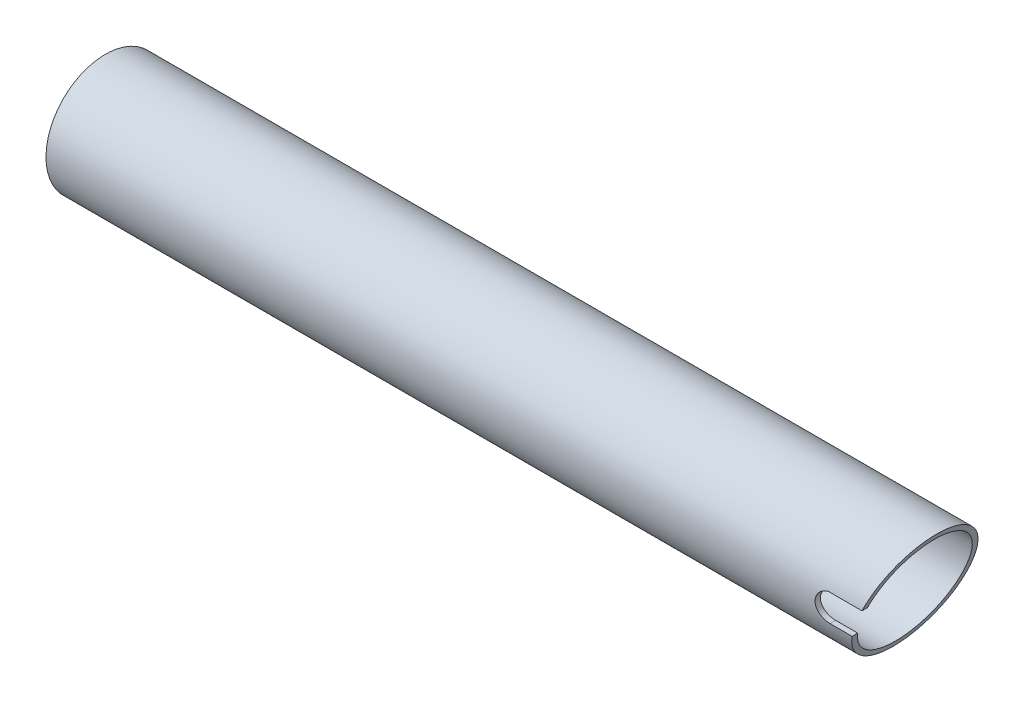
ISO-10303-21;
HEADER;
FILE_DESCRIPTION(('STEP AP214'),'2;1');
FILE_NAME('part.step','',(''),(''),'','','');
FILE_SCHEMA(('AUTOMOTIVE_DESIGN { 1 0 10303 214 1 1 1 1 }'));
ENDSEC;
DATA;
#1=APPLICATION_CONTEXT('core data for automotive mechanical design processes');
#2=APPLICATION_PROTOCOL_DEFINITION('international standard','automotive_design',2000,#1);
#3=PRODUCT_CONTEXT('',#1,'mechanical');
#4=PRODUCT('Part','Part','',(#3));
#5=PRODUCT_RELATED_PRODUCT_CATEGORY('part','',(#4));
#6=PRODUCT_DEFINITION_FORMATION('','',#4);
#7=PRODUCT_DEFINITION_CONTEXT('part definition',#1,'design');
#8=PRODUCT_DEFINITION('design','',#6,#7);
#9=PRODUCT_DEFINITION_SHAPE('','',#8);
#10=(LENGTH_UNIT() NAMED_UNIT(*) SI_UNIT(.MILLI.,.METRE.));
#11=(NAMED_UNIT(*) PLANE_ANGLE_UNIT() SI_UNIT($,.RADIAN.));
#12=(NAMED_UNIT(*) SI_UNIT($,.STERADIAN.) SOLID_ANGLE_UNIT());
#13=UNCERTAINTY_MEASURE_WITH_UNIT(LENGTH_MEASURE(1.E-05),#10,'distance_accuracy_value','');
#14=(GEOMETRIC_REPRESENTATION_CONTEXT(3) GLOBAL_UNCERTAINTY_ASSIGNED_CONTEXT((#13)) GLOBAL_UNIT_ASSIGNED_CONTEXT((#10,
#11,#12)) REPRESENTATION_CONTEXT('',''));
#15=CARTESIAN_POINT('',(0.,0.,0.));
#16=DIRECTION('',(0.,0.,1.));
#17=DIRECTION('',(1.,0.,0.));
#18=AXIS2_PLACEMENT_3D('',#15,#16,#17);
#19=CARTESIAN_POINT('',(160.,0.,0.));
#20=DIRECTION('',(-1.,0.,0.));
#21=DIRECTION('',(0.,0.,1.));
#22=AXIS2_PLACEMENT_3D('',#19,#20,#21);
#23=CYLINDRICAL_SURFACE('',#22,11.);
#24=CARTESIAN_POINT('',(0.,0.,0.));
#25=DIRECTION('',(1.,0.,0.));
#26=DIRECTION('',(0.,0.,-1.));
#27=AXIS2_PLACEMENT_3D('',#24,#25,#26);
#28=CIRCLE('',#27,11.);
#29=CARTESIAN_POINT('',(0.,0.,-11.));
#30=VERTEX_POINT('',#29);
#31=EDGE_CURVE('E92',#30,#30,#28,.T.);
#32=ORIENTED_EDGE('',*,*,#31,.T.);
#33=EDGE_LOOP('',(#32));
#34=FACE_BOUND('',#33,.T.);
#35=DIRECTION('',(-1.,0.,0.));
#36=VECTOR('',#35,1.);
#37=CARTESIAN_POINT('',(160.,2.50000000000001,10.7121426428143));
#38=LINE('',#37,#36);
#39=CARTESIAN_POINT('',(150.909925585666,2.5,10.7121426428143));
#40=VERTEX_POINT('',#39);
#41=CARTESIAN_POINT('',(145.,2.5,10.7121426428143));
#42=VERTEX_POINT('',#41);
#43=EDGE_CURVE('E106',#40,#42,#38,.T.);
#44=ORIENTED_EDGE('',*,*,#43,.F.);
#45=CARTESIAN_POINT('',(150.,0.,0.));
#46=DIRECTION('',(0.939692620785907,-0.342020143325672,0.));
#47=DIRECTION('',(-0.342020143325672,-0.939692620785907,0.));
#48=AXIS2_PLACEMENT_3D('',#45,#46,#47);
#49=ELLIPSE('',#48,11.705955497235,11.);
#50=CARTESIAN_POINT('',(149.090074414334,-2.5,10.7121426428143));
#51=VERTEX_POINT('',#50);
#52=EDGE_CURVE('E101',#51,#40,#49,.T.);
#53=ORIENTED_EDGE('',*,*,#52,.F.);
#54=DIRECTION('',(-1.,0.,0.));
#55=VECTOR('',#54,1.);
#56=CARTESIAN_POINT('',(160.,-2.5,10.7121426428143));
#57=LINE('',#56,#55);
#58=CARTESIAN_POINT('',(145.,-2.5,10.7121426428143));
#59=VERTEX_POINT('',#58);
#60=EDGE_CURVE('E58',#59,#51,#57,.F.);
#61=ORIENTED_EDGE('',*,*,#60,.F.);
#62=CARTESIAN_POINT('',(145.,2.5,10.7121426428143));
#63=CARTESIAN_POINT('',(144.930656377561,2.50000778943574,10.7121357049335));
#64=CARTESIAN_POINT('',(144.861317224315,2.49711498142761,10.7128158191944));
#65=CARTESIAN_POINT('',(144.723153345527,2.4855886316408,10.7154987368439));
#66=CARTESIAN_POINT('',(144.654328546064,2.4769559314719,10.7175013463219));
#67=CARTESIAN_POINT('',(144.517798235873,2.45403037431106,10.7227732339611));
#68=CARTESIAN_POINT('',(144.450090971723,2.43974748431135,10.7260402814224));
#69=CARTESIAN_POINT('',(144.316170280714,2.40565123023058,10.7337386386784));
#70=CARTESIAN_POINT('',(144.249956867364,2.38583781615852,10.7381699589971));
#71=CARTESIAN_POINT('',(144.054249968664,2.3183092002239,10.7530273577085));
#72=CARTESIAN_POINT('',(143.927566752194,2.2624847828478,10.765021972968));
#73=CARTESIAN_POINT('',(143.68540296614,2.1309292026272,10.7918310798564));
#74=CARTESIAN_POINT('',(143.569924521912,2.05519427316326,10.8066461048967));
#75=CARTESIAN_POINT('',(143.351294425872,1.88448995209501,10.8377270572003));
#76=CARTESIAN_POINT('',(143.248373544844,1.78922803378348,10.8540126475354));
#77=CARTESIAN_POINT('',(143.059822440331,1.58280149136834,10.8860291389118));
#78=CARTESIAN_POINT('',(142.974194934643,1.47163437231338,10.9017599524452));
#79=CARTESIAN_POINT('',(142.821735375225,1.23498721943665,10.9311097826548));
#80=CARTESIAN_POINT('',(142.755128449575,1.1093586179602,10.9447027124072));
#81=CARTESIAN_POINT('',(142.644064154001,0.84833678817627,10.9680202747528));
#82=CARTESIAN_POINT('',(142.599602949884,0.712945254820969,10.9777455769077));
#83=CARTESIAN_POINT('',(142.534822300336,0.438657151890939,10.9920932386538));
#84=CARTESIAN_POINT('',(142.514108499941,0.299858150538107,10.9967988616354));
#85=CARTESIAN_POINT('',(142.496176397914,0.0206776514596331,11.000865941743));
#86=CARTESIAN_POINT('',(142.498955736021,-0.119703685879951,11.000227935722));
#87=CARTESIAN_POINT('',(142.52764078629,-0.395334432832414,10.9937426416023));
#88=CARTESIAN_POINT('',(142.55312072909,-0.530630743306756,10.9879912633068));
#89=CARTESIAN_POINT('',(142.625803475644,-0.794974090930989,10.9720354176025));
#90=CARTESIAN_POINT('',(142.673007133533,-0.924020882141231,10.9618307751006));
#91=CARTESIAN_POINT('',(142.788166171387,-1.17337116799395,10.9379625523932));
#92=CARTESIAN_POINT('',(142.856280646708,-1.29359855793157,10.9242725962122));
#93=CARTESIAN_POINT('',(143.011207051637,-1.52106697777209,10.8949312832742));
#94=CARTESIAN_POINT('',(143.09802120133,-1.62830646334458,10.879279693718));
#95=CARTESIAN_POINT('',(143.290179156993,-1.82928124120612,10.8473190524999));
#96=CARTESIAN_POINT('',(143.395893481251,-1.92266146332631,10.8310031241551));
#97=CARTESIAN_POINT('',(143.621683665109,-2.09046125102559,10.7998740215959));
#98=CARTESIAN_POINT('',(143.74176343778,-2.16487563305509,10.7850612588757));
#99=CARTESIAN_POINT('',(143.993500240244,-2.29281096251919,10.7585928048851));
#100=CARTESIAN_POINT('',(144.125201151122,-2.34624817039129,10.7469498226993));
#101=CARTESIAN_POINT('',(144.395960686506,-2.43005142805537,10.7283141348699));
#102=CARTESIAN_POINT('',(144.535008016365,-2.46045185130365,10.7213145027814));
#103=CARTESIAN_POINT('',(144.729346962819,-2.48590221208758,10.7154245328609));
#104=CARTESIAN_POINT('',(144.783381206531,-2.49119027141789,10.71419544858));
#105=CARTESIAN_POINT('',(144.891601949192,-2.49823495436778,10.7125550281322));
#106=CARTESIAN_POINT('',(144.945788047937,-2.49999741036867,10.7121423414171));
#107=CARTESIAN_POINT('',(145.,-2.5,10.7121426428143));
#108=B_SPLINE_CURVE_WITH_KNOTS('',3,(#62,#63,#64,#65,#66,#67,#68,#69,#70,#71,#72,#73,#74,#75,
#76,#77,#78,#79,#80,#81,#82,#83,#84,#85,#86,#87,#88,#89,#90,#91,#92,#93,#94,#95,#96,#97,#98,#99,
#100,#101,#102,#103,#104,#105,#106,#107),.UNSPECIFIED.,.F.,.F.,(4,2,2,2,2,2,2,2,2,2,2,2,2,2,2,2,
2,2,2,2,2,2,4),(0.,0.207959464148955,0.415888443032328,0.623452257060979,0.831017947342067,
1.24577925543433,1.66061908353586,2.08219920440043,2.50384552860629,2.93029316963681,
3.35666695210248,3.77585276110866,4.19499645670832,4.60644048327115,5.01790068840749,
5.43257241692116,5.84729340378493,6.27127621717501,6.69537478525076,7.12114951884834,
7.54628769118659,7.70911145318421,7.87166563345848),.UNSPECIFIED.);
#109=EDGE_CURVE('E102',#42,#59,#108,.T.);
#110=ORIENTED_EDGE('',*,*,#109,.F.);
#111=EDGE_LOOP('',(#44,#53,#61,#110));
#112=FACE_BOUND('',#111,.T.);
#113=ADVANCED_FACE('F38',(#34,#112),#23,.T.);
#114=CARTESIAN_POINT('',(160.,0.,0.));
#115=DIRECTION('',(-1.,0.,0.));
#116=DIRECTION('',(0.,0.,1.));
#117=AXIS2_PLACEMENT_3D('',#114,#115,#116);
#118=CYLINDRICAL_SURFACE('',#117,10.);
#119=CARTESIAN_POINT('',(0.,0.,0.));
#120=DIRECTION('',(1.,0.,0.));
#121=DIRECTION('',(0.,0.,-1.));
#122=AXIS2_PLACEMENT_3D('',#119,#120,#121);
#123=CIRCLE('',#122,10.);
#124=CARTESIAN_POINT('',(0.,0.,-10.));
#125=VERTEX_POINT('',#124);
#126=EDGE_CURVE('E104',#125,#125,#123,.T.);
#127=ORIENTED_EDGE('',*,*,#126,.F.);
#128=EDGE_LOOP('',(#127));
#129=FACE_BOUND('',#128,.T.);
#130=CARTESIAN_POINT('',(150.,0.,0.));
#131=DIRECTION('',(0.939692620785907,-0.342020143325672,0.));
#132=DIRECTION('',(-0.342020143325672,-0.939692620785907,0.));
#133=AXIS2_PLACEMENT_3D('',#130,#131,#132);
#134=ELLIPSE('',#133,10.6417777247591,10.);
#135=CARTESIAN_POINT('',(149.090074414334,-2.5,9.68245836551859));
#136=VERTEX_POINT('',#135);
#137=CARTESIAN_POINT('',(150.909925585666,2.5,9.68245836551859));
#138=VERTEX_POINT('',#137);
#139=EDGE_CURVE('E97',#136,#138,#134,.T.);
#140=ORIENTED_EDGE('',*,*,#139,.T.);
#141=DIRECTION('',(-1.,0.,0.));
#142=VECTOR('',#141,1.);
#143=CARTESIAN_POINT('',(160.,2.50000000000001,9.68245836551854));
#144=LINE('',#143,#142);
#145=CARTESIAN_POINT('',(145.,2.5,9.68245836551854));
#146=VERTEX_POINT('',#145);
#147=EDGE_CURVE('E66',#138,#146,#144,.T.);
#148=ORIENTED_EDGE('',*,*,#147,.T.);
#149=CARTESIAN_POINT('',(145.,2.5,9.68245836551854));
#150=CARTESIAN_POINT('',(144.93086221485,2.5000080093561,9.68245064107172));
#151=CARTESIAN_POINT('',(144.861729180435,2.49713210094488,9.68319871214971));
#152=CARTESIAN_POINT('',(144.723980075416,2.4856746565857,9.68614915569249));
#153=CARTESIAN_POINT('',(144.655363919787,2.477094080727,9.68835128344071));
#154=CARTESIAN_POINT('',(144.519267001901,2.4543119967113,9.69414685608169));
#155=CARTESIAN_POINT('',(144.451784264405,2.44012162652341,9.69773754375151));
#156=CARTESIAN_POINT('',(144.31831118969,2.40625174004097,9.70619672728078));
#157=CARTESIAN_POINT('',(144.252320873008,2.3865721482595,9.71106524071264));
#158=CARTESIAN_POINT('',(144.057289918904,2.31951549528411,9.72738369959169));
#159=CARTESIAN_POINT('',(143.93105255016,2.26409745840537,9.74055281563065));
#160=CARTESIAN_POINT('',(143.689694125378,2.13353299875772,9.76997886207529));
#161=CARTESIAN_POINT('',(143.57457606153,2.05838128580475,9.78623662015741));
#162=CARTESIAN_POINT('',(143.356147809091,1.88871268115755,9.82040642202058));
#163=CARTESIAN_POINT('',(143.253114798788,1.79384357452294,9.838344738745));
#164=CARTESIAN_POINT('',(143.06424276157,1.58818904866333,9.87362764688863));
#165=CARTESIAN_POINT('',(142.978406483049,1.47740109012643,9.89097214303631));
#166=CARTESIAN_POINT('',(142.825223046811,1.24114235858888,9.92340454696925));
#167=CARTESIAN_POINT('',(142.758150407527,1.11548838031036,9.93845761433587));
#168=CARTESIAN_POINT('',(142.64618801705,0.854256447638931,9.96430865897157));
#169=CARTESIAN_POINT('',(142.601293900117,0.718680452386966,9.97510747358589));
#170=CARTESIAN_POINT('',(142.535852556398,0.444360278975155,9.99104749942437));
#171=CARTESIAN_POINT('',(142.514830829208,0.305735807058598,9.99629882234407));
#172=CARTESIAN_POINT('',(142.496241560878,0.0268319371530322,10.0009359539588));
#173=CARTESIAN_POINT('',(142.498671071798,-0.113447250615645,10.0003224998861));
#174=CARTESIAN_POINT('',(142.526574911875,-0.388381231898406,9.99338093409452));
#175=CARTESIAN_POINT('',(142.551536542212,-0.523091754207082,9.98717996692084));
#176=CARTESIAN_POINT('',(142.622971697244,-0.7863467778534,9.96990826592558));
#177=CARTESIAN_POINT('',(142.66944617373,-0.914891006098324,9.95883731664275));
#178=CARTESIAN_POINT('',(142.78300320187,-1.16351821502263,9.93287494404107));
#179=CARTESIAN_POINT('',(142.850268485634,-1.28351407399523,9.91794984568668));
#180=CARTESIAN_POINT('',(143.003357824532,-1.51069157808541,9.88589863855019));
#181=CARTESIAN_POINT('',(143.089184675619,-1.61787128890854,9.86877219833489));
#182=CARTESIAN_POINT('',(143.279697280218,-1.81942347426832,9.83363915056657));
#183=CARTESIAN_POINT('',(143.384829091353,-1.9133727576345,9.81562126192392));
#184=CARTESIAN_POINT('',(143.609574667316,-2.08242393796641,9.78115420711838));
#185=CARTESIAN_POINT('',(143.729192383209,-2.15752067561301,9.76470547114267));
#186=CARTESIAN_POINT('',(143.980363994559,-2.28701177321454,9.73519533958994));
#187=CARTESIAN_POINT('',(144.111978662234,-2.34129254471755,9.72215264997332));
#188=CARTESIAN_POINT('',(144.382792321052,-2.42675587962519,9.70117647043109));
#189=CARTESIAN_POINT('',(144.521979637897,-2.45797297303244,9.69323534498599));
#190=CARTESIAN_POINT('',(144.718643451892,-2.48476158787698,9.68638226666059));
#191=CARTESIAN_POINT('',(144.774799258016,-2.49047697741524,9.68491307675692));
#192=CARTESIAN_POINT('',(144.887294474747,-2.49809189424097,9.6829515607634));
#193=CARTESIAN_POINT('',(144.943633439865,-2.49999759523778,9.68245765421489));
#194=CARTESIAN_POINT('',(145.,-2.5,9.68245836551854));
#195=B_SPLINE_CURVE_WITH_KNOTS('',3,(#149,#150,#151,#152,#153,#154,#155,#156,#157,#158,#159,
#160,#161,#162,#163,#164,#165,#166,#167,#168,#169,#170,#171,#172,#173,#174,#175,#176,#177,#178,
#179,#180,#181,#182,#183,#184,#185,#186,#187,#188,#189,#190,#191,#192,#193,#194),.UNSPECIFIED.,
.F.,.F.,(4,2,2,2,2,2,2,2,2,2,2,2,2,2,2,2,2,2,2,2,2,2,4),(0.,0.207341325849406,0.414647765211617,
0.621544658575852,0.828444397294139,1.24183269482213,1.65533192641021,2.07697423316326,
2.49868387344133,2.92627416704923,3.35378025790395,3.77263152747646,4.19143014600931,
4.60093312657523,5.01045422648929,5.42368222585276,5.83697251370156,6.2614052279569,
6.68595396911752,7.11278749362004,7.53898067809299,7.70826570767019,7.87727618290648),.UNSPECIFIED.);
#196=CARTESIAN_POINT('',(145.,-2.5,9.68245836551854));
#197=VERTEX_POINT('',#196);
#198=EDGE_CURVE('E12',#146,#197,#195,.T.);
#199=ORIENTED_EDGE('',*,*,#198,.T.);
#200=DIRECTION('',(-1.,0.,0.));
#201=VECTOR('',#200,1.);
#202=CARTESIAN_POINT('',(160.,-2.5,9.68245836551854));
#203=LINE('',#202,#201);
#204=EDGE_CURVE('E86',#197,#136,#203,.F.);
#205=ORIENTED_EDGE('',*,*,#204,.T.);
#206=EDGE_LOOP('',(#140,#148,#199,#205));
#207=FACE_BOUND('',#206,.T.);
#208=ADVANCED_FACE('F96',(#129,#207),#118,.F.);
#209=CARTESIAN_POINT('',(154.003672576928,11.,217.496165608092));
#210=DIRECTION('',(0.939692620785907,-0.342020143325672,0.));
#211=DIRECTION('',(0.342020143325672,0.939692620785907,0.));
#212=AXIS2_PLACEMENT_3D('',#209,#210,#211);
#213=PLANE('',#212);
#214=ORIENTED_EDGE('',*,*,#52,.T.);
#215=DIRECTION('',(0.,0.,-1.));
#216=VECTOR('',#215,1.);
#217=CARTESIAN_POINT('',(150.909925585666,2.5,217.496165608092));
#218=LINE('',#217,#216);
#219=EDGE_CURVE('E51',#40,#138,#218,.T.);
#220=ORIENTED_EDGE('',*,*,#219,.T.);
#221=ORIENTED_EDGE('',*,*,#139,.F.);
#222=DIRECTION('',(0.,0.,1.));
#223=VECTOR('',#222,1.);
#224=CARTESIAN_POINT('',(149.090074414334,-2.5,217.496165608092));
#225=LINE('',#224,#223);
#226=EDGE_CURVE('E83',#136,#51,#225,.T.);
#227=ORIENTED_EDGE('',*,*,#226,.T.);
#228=EDGE_LOOP('',(#214,#220,#221,#227));
#229=FACE_BOUND('',#228,.T.);
#230=ADVANCED_FACE('F100',(#229),#213,.T.);
#231=CARTESIAN_POINT('',(0.,0.,0.));
#232=DIRECTION('',(1.,0.,0.));
#233=DIRECTION('',(0.,0.,-1.));
#234=AXIS2_PLACEMENT_3D('',#231,#232,#233);
#235=PLANE('',#234);
#236=ORIENTED_EDGE('',*,*,#31,.F.);
#237=EDGE_LOOP('',(#236));
#238=FACE_BOUND('',#237,.T.);
#239=ORIENTED_EDGE('',*,*,#126,.T.);
#240=EDGE_LOOP('',(#239));
#241=FACE_BOUND('',#240,.T.);
#242=ADVANCED_FACE('F123',(#238,#241),#235,.F.);
#243=CARTESIAN_POINT('',(145.,0.,11.));
#244=DIRECTION('',(0.,0.,-1.));
#245=DIRECTION('',(-1.,0.,0.));
#246=AXIS2_PLACEMENT_3D('',#243,#244,#245);
#247=CYLINDRICAL_SURFACE('',#246,2.5);
#248=ORIENTED_EDGE('',*,*,#109,.T.);
#249=DIRECTION('',(0.,0.,-1.));
#250=VECTOR('',#249,1.);
#251=CARTESIAN_POINT('',(145.,-2.5,11.));
#252=LINE('',#251,#250);
#253=EDGE_CURVE('E149',#59,#197,#252,.T.);
#254=ORIENTED_EDGE('',*,*,#253,.T.);
#255=ORIENTED_EDGE('',*,*,#198,.F.);
#256=DIRECTION('',(0.,0.,-1.));
#257=VECTOR('',#256,1.);
#258=CARTESIAN_POINT('',(145.,2.5,11.));
#259=LINE('',#258,#257);
#260=EDGE_CURVE('E98',#42,#146,#259,.T.);
#261=ORIENTED_EDGE('',*,*,#260,.F.);
#262=EDGE_LOOP('',(#248,#254,#255,#261));
#263=FACE_BOUND('',#262,.T.);
#264=ADVANCED_FACE('F117',(#263),#247,.F.);
#265=CARTESIAN_POINT('',(150.909925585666,2.5,11.));
#266=DIRECTION('',(0.,-1.,0.));
#267=DIRECTION('',(1.,0.,0.));
#268=AXIS2_PLACEMENT_3D('',#265,#266,#267);
#269=PLANE('',#268);
#270=ORIENTED_EDGE('',*,*,#43,.T.);
#271=ORIENTED_EDGE('',*,*,#260,.T.);
#272=ORIENTED_EDGE('',*,*,#147,.F.);
#273=ORIENTED_EDGE('',*,*,#219,.F.);
#274=EDGE_LOOP('',(#270,#271,#272,#273));
#275=FACE_BOUND('',#274,.T.);
#276=ADVANCED_FACE('F122',(#275),#269,.T.);
#277=CARTESIAN_POINT('',(145.,-2.5,11.));
#278=DIRECTION('',(0.,1.,0.));
#279=DIRECTION('',(0.,0.,1.));
#280=AXIS2_PLACEMENT_3D('',#277,#278,#279);
#281=PLANE('',#280);
#282=ORIENTED_EDGE('',*,*,#60,.T.);
#283=ORIENTED_EDGE('',*,*,#226,.F.);
#284=ORIENTED_EDGE('',*,*,#204,.F.);
#285=ORIENTED_EDGE('',*,*,#253,.F.);
#286=EDGE_LOOP('',(#282,#283,#284,#285));
#287=FACE_BOUND('',#286,.T.);
#288=ADVANCED_FACE('F85',(#287),#281,.T.);
#289=CLOSED_SHELL('',(#113,#208,#230,#242,#264,#276,#288));
#290=MANIFOLD_SOLID_BREP('B2',#289);
#291=ADVANCED_BREP_SHAPE_REPRESENTATION('',(#18,#290),#14);
#292=SHAPE_DEFINITION_REPRESENTATION(#9,#291);
ENDSEC;
END-ISO-10303-21;
